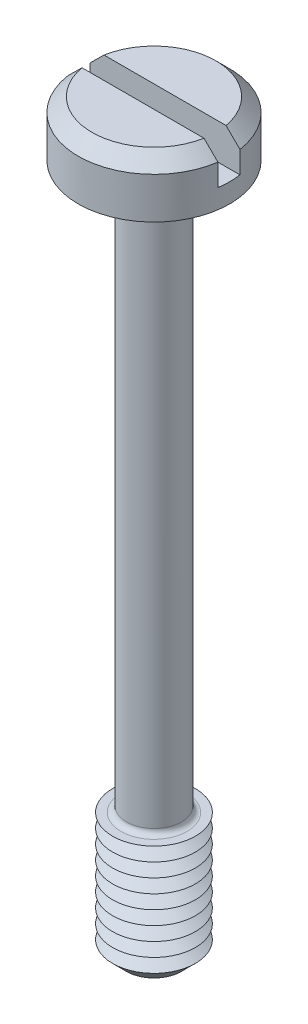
ISO-10303-21;
HEADER;
FILE_DESCRIPTION(('STEP AP214'),'2;1');
FILE_NAME('part.step','',(''),(''),'','','');
FILE_SCHEMA(('AUTOMOTIVE_DESIGN { 1 0 10303 214 1 1 1 1 }'));
ENDSEC;
DATA;
#1=APPLICATION_CONTEXT('core data for automotive mechanical design processes');
#2=APPLICATION_PROTOCOL_DEFINITION('international standard','automotive_design',2000,#1);
#3=PRODUCT_CONTEXT('',#1,'mechanical');
#4=PRODUCT('Part','Part','',(#3));
#5=PRODUCT_RELATED_PRODUCT_CATEGORY('part','',(#4));
#6=PRODUCT_DEFINITION_FORMATION('','',#4);
#7=PRODUCT_DEFINITION_CONTEXT('part definition',#1,'design');
#8=PRODUCT_DEFINITION('design','',#6,#7);
#9=PRODUCT_DEFINITION_SHAPE('','',#8);
#10=(LENGTH_UNIT() NAMED_UNIT(*) SI_UNIT(.MILLI.,.METRE.));
#11=(NAMED_UNIT(*) PLANE_ANGLE_UNIT() SI_UNIT($,.RADIAN.));
#12=(NAMED_UNIT(*) SI_UNIT($,.STERADIAN.) SOLID_ANGLE_UNIT());
#13=UNCERTAINTY_MEASURE_WITH_UNIT(LENGTH_MEASURE(1.E-05),#10,'distance_accuracy_value','');
#14=(GEOMETRIC_REPRESENTATION_CONTEXT(3) GLOBAL_UNCERTAINTY_ASSIGNED_CONTEXT((#13)) GLOBAL_UNIT_ASSIGNED_CONTEXT((#10,
#11,#12)) REPRESENTATION_CONTEXT('',''));
#15=CARTESIAN_POINT('',(0.,0.,0.));
#16=DIRECTION('',(0.,0.,1.));
#17=DIRECTION('',(1.,0.,0.));
#18=AXIS2_PLACEMENT_3D('',#15,#16,#17);
#19=CARTESIAN_POINT('',(0.,2.,0.));
#20=DIRECTION('',(0.,1.,0.));
#21=DIRECTION('',(0.,0.,1.));
#22=AXIS2_PLACEMENT_3D('',#19,#20,#21);
#23=PLANE('',#22);
#24=DIRECTION('',(-1.,0.,0.));
#25=VECTOR('',#24,1.);
#26=CARTESIAN_POINT('',(2.75,2.,-0.4));
#27=LINE('',#26,#25);
#28=CARTESIAN_POINT('',(2.21415898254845,2.,-0.4));
#29=VERTEX_POINT('',#28);
#30=CARTESIAN_POINT('',(-2.21415898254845,2.,-0.4));
#31=VERTEX_POINT('',#30);
#32=EDGE_CURVE('E110',#29,#31,#27,.T.);
#33=ORIENTED_EDGE('',*,*,#32,.F.);
#34=CARTESIAN_POINT('',(0.,2.,0.));
#35=DIRECTION('',(0.,1.,0.));
#36=DIRECTION('',(0.,0.,1.));
#37=AXIS2_PLACEMENT_3D('',#34,#35,#36);
#38=CIRCLE('',#37,2.25);
#39=EDGE_CURVE('E113',#29,#31,#38,.T.);
#40=ORIENTED_EDGE('',*,*,#39,.T.);
#41=EDGE_LOOP('',(#33,#40));
#42=FACE_BOUND('',#41,.T.);
#43=ADVANCED_FACE('F39',(#42),#23,.T.);
#44=CARTESIAN_POINT('',(0.,2.,0.));
#45=DIRECTION('',(0.,-1.,0.));
#46=DIRECTION('',(0.,0.,-1.));
#47=AXIS2_PLACEMENT_3D('',#44,#45,#46);
#48=CONICAL_SURFACE('',#47,2.25,0.785398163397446);
#49=CARTESIAN_POINT('',(6.05060089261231,-1.81380830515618,-0.4));
#50=CARTESIAN_POINT('',(5.84217393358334,-1.60583904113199,-0.4));
#51=CARTESIAN_POINT('',(5.63372707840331,-1.3978896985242,-0.4));
#52=CARTESIAN_POINT('',(5.21676338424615,-0.982052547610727,-0.4));
#53=CARTESIAN_POINT('',(5.00824654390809,-0.774164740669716,-0.4));
#54=CARTESIAN_POINT('',(4.59102343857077,-0.358383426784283,-0.4));
#55=CARTESIAN_POINT('',(4.38231713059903,-0.150489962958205,-0.4));
#56=CARTESIAN_POINT('',(3.96477014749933,0.265153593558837,-0.4));
#57=CARTESIAN_POINT('',(3.75592947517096,0.472903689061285,-0.4));
#58=CARTESIAN_POINT('',(3.33589913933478,0.89028798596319,-0.4));
#59=CARTESIAN_POINT('',(3.12470717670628,1.09991987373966,-0.4));
#60=CARTESIAN_POINT('',(2.7019134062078,1.51879562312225,-0.4));
#61=CARTESIAN_POINT('',(2.49031157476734,1.72803946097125,-0.4));
#62=CARTESIAN_POINT('',(2.17231429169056,2.04123939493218,-0.4));
#63=CARTESIAN_POINT('',(2.06623184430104,2.14551302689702,-0.4));
#64=CARTESIAN_POINT('',(1.85373145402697,2.35372301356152,-0.4));
#65=CARTESIAN_POINT('',(1.74731350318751,2.45765936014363,-0.4));
#66=CARTESIAN_POINT('',(1.53394692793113,2.6649644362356,-0.4));
#67=CARTESIAN_POINT('',(1.42699836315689,2.76833322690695,-0.4));
#68=CARTESIAN_POINT('',(1.26580938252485,2.92258234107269,-0.4));
#69=CARTESIAN_POINT('',(1.21195308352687,2.97386371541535,-0.4));
#70=CARTESIAN_POINT('',(1.10386632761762,3.07603025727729,-0.4));
#71=CARTESIAN_POINT('',(1.0496358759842,3.126915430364,-0.4));
#72=CARTESIAN_POINT('',(0.965529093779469,3.20495157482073,-0.4));
#73=CARTESIAN_POINT('',(0.935852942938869,3.23231811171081,-0.4));
#74=CARTESIAN_POINT('',(0.876282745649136,3.28681446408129,-0.4));
#75=CARTESIAN_POINT('',(0.846388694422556,3.31394427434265,-0.4));
#76=CARTESIAN_POINT('',(0.786319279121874,3.36788760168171,-0.4));
#77=CARTESIAN_POINT('',(0.756143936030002,3.39470114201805,-0.4));
#78=CARTESIAN_POINT('',(0.695411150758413,3.44788757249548,-0.4));
#79=CARTESIAN_POINT('',(0.664853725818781,3.4742604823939,-0.4));
#80=CARTESIAN_POINT('',(0.587773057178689,3.53947080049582,-0.4));
#81=CARTESIAN_POINT('',(0.540923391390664,3.57793090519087,-0.4));
#82=CARTESIAN_POINT('',(0.469108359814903,3.63368803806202,-0.4));
#83=CARTESIAN_POINT('',(0.444902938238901,3.65195872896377,-0.4));
#84=CARTESIAN_POINT('',(0.395796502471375,3.68753467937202,-0.4));
#85=CARTESIAN_POINT('',(0.370895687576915,3.70484021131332,-0.4));
#86=CARTESIAN_POINT('',(0.315135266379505,3.74129905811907,-0.4));
#87=CARTESIAN_POINT('',(0.284069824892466,3.76014262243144,-0.4));
#88=CARTESIAN_POINT('',(0.220007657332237,3.79429188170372,-0.4));
#89=CARTESIAN_POINT('',(0.187014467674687,3.80960381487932,-0.4));
#90=CARTESIAN_POINT('',(0.129469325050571,3.83013103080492,-0.4));
#91=CARTESIAN_POINT('',(0.105533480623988,3.83700748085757,-0.4));
#92=CARTESIAN_POINT('',(0.0568861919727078,3.84667143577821,-0.4));
#93=CARTESIAN_POINT('',(0.0321777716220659,3.84947323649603,-0.4));
#94=CARTESIAN_POINT('',(-0.017455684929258,3.85039131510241,-0.4));
#95=CARTESIAN_POINT('',(-0.0423811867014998,3.84848412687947,-0.4));
#96=CARTESIAN_POINT('',(-0.0915464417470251,3.8403829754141,-0.4));
#97=CARTESIAN_POINT('',(-0.115784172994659,3.83417751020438,-0.4));
#98=CARTESIAN_POINT('',(-0.16401593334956,3.81830420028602,-0.4));
#99=CARTESIAN_POINT('',(-0.18796977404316,3.80851974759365,-0.4));
#100=CARTESIAN_POINT('',(-0.234812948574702,3.78663483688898,-0.4));
#101=CARTESIAN_POINT('',(-0.257700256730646,3.77453017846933,-0.4));
#102=CARTESIAN_POINT('',(-0.302761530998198,3.74868049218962,-0.4));
#103=CARTESIAN_POINT('',(-0.324928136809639,3.73492286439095,-0.4));
#104=CARTESIAN_POINT('',(-0.368536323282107,3.70635481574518,-0.4));
#105=CARTESIAN_POINT('',(-0.389978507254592,3.69154530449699,-0.4));
#106=CARTESIAN_POINT('',(-0.457169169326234,3.64340388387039,-0.4));
#107=CARTESIAN_POINT('',(-0.501937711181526,3.60871473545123,-0.4));
#108=CARTESIAN_POINT('',(-0.590074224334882,3.53759028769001,-0.4));
#109=CARTESIAN_POINT('',(-0.633441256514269,3.50115385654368,-0.4));
#110=CARTESIAN_POINT('',(-0.719371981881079,3.42718980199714,-0.4));
#111=CARTESIAN_POINT('',(-0.761934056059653,3.3896603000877,-0.4));
#112=CARTESIAN_POINT('',(-0.846465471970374,3.31396862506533,-0.4));
#113=CARTESIAN_POINT('',(-0.888434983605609,3.27580664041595,-0.4));
#114=CARTESIAN_POINT('',(-1.01351008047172,3.16091722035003,-0.4));
#115=CARTESIAN_POINT('',(-1.09603733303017,3.0835613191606,-0.4));
#116=CARTESIAN_POINT('',(-1.26020205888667,2.92809304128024,-0.4));
#117=CARTESIAN_POINT('',(-1.3418403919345,2.84998156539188,-0.4));
#118=CARTESIAN_POINT('',(-1.50425180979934,2.69362860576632,-0.4));
#119=CARTESIAN_POINT('',(-1.58502715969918,2.61538947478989,-0.4));
#120=CARTESIAN_POINT('',(-1.74627332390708,2.45859784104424,-0.4));
#121=CARTESIAN_POINT('',(-1.82674413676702,2.38004533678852,-0.4));
#122=CARTESIAN_POINT('',(-2.06785619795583,2.14407469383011,-0.4));
#123=CARTESIAN_POINT('',(-2.22819388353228,1.98634651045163,-0.4));
#124=CARTESIAN_POINT('',(-2.54852691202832,1.67040441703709,-0.4));
#125=CARTESIAN_POINT('',(-2.70852207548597,1.51219032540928,-0.4));
#126=CARTESIAN_POINT('',(-3.02826273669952,1.19551306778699,-0.4));
#127=CARTESIAN_POINT('',(-3.18800823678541,1.03704990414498,-0.4));
#128=CARTESIAN_POINT('',(-3.6669908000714,0.561455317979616,-0.4));
#129=CARTESIAN_POINT('',(-3.98599924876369,0.244093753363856,-0.4));
#130=CARTESIAN_POINT('',(-4.6236988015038,-0.390879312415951,-0.4));
#131=CARTESIAN_POINT('',(-4.94238993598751,-0.708490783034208,-0.4));
#132=CARTESIAN_POINT('',(-5.39262624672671,-1.15743192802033,-0.4));
#133=CARTESIAN_POINT('',(-5.52423897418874,-1.28869385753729,-0.4));
#134=CARTESIAN_POINT('',(-5.78743776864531,-1.5512369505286,-0.4));
#135=CARTESIAN_POINT('',(-5.91902383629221,-1.68251811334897,-0.4));
#136=CARTESIAN_POINT('',(-6.05060089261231,-1.81380830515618,-0.4));
#137=B_SPLINE_CURVE_WITH_KNOTS('',3,(#49,#50,#51,#52,#53,#54,#55,#56,#57,#58,#59,#60,#61,#62,
#63,#64,#65,#66,#67,#68,#69,#70,#71,#72,#73,#74,#75,#76,#77,#78,#79,#80,#81,#82,#83,#84,#85,#86,
#87,#88,#89,#90,#91,#92,#93,#94,#95,#96,#97,#98,#99,#100,#101,#102,#103,#104,#105,#106,#107,
#108,#109,#110,#111,#112,#113,#114,#115,#116,#117,#118,#119,#120,#121,#122,#123,#124,#125,#126,
#127,#128,#129,#130,#131,#132,#133,#134,#135,#136),.UNSPECIFIED.,.F.,.F.,(4,2,2,2,2,2,2,2,2,2,2,
2,2,2,2,2,2,2,2,2,2,2,2,2,2,2,2,2,2,2,2,2,2,2,2,2,2,2,2,2,2,2,2,4),(0.,0.883310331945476,
1.76663897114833,2.6503821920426,3.53410755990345,4.42681573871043,5.31957687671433,
5.76582544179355,6.21208466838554,6.65829482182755,6.88139126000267,7.10448455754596,
7.22558850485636,7.34669511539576,7.46779276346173,7.58888496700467,7.77066509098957,
7.86163037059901,7.95256984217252,8.06146372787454,8.17016376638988,8.24461141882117,
8.31879723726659,8.39335348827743,8.46811002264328,8.54555790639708,8.62314734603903,
8.70137101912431,8.77952785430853,8.94932745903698,9.11923857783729,9.28946128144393,
9.45963414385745,9.79895964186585,10.1379210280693,10.475282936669,10.8126464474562,
11.4873867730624,12.1624208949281,12.8374486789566,14.1873973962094,15.5372009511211,
16.0948428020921,16.6524687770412),.UNSPECIFIED.);
#138=CARTESIAN_POINT('',(2.72075357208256,1.5,-0.4));
#139=VERTEX_POINT('',#138);
#140=EDGE_CURVE('E260',#139,#29,#137,.T.);
#141=ORIENTED_EDGE('',*,*,#140,.F.);
#142=CARTESIAN_POINT('',(0.,1.5,0.));
#143=DIRECTION('',(0.,1.,0.));
#144=DIRECTION('',(0.,0.,1.));
#145=AXIS2_PLACEMENT_3D('',#142,#143,#144);
#146=CIRCLE('',#145,2.75);
#147=CARTESIAN_POINT('',(-2.72075357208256,1.5,-0.4));
#148=VERTEX_POINT('',#147);
#149=EDGE_CURVE('E128',#148,#139,#146,.F.);
#150=ORIENTED_EDGE('',*,*,#149,.F.);
#151=EDGE_CURVE('E102',#31,#148,#137,.T.);
#152=ORIENTED_EDGE('',*,*,#151,.F.);
#153=ORIENTED_EDGE('',*,*,#39,.F.);
#154=EDGE_LOOP('',(#141,#150,#152,#153));
#155=FACE_BOUND('',#154,.T.);
#156=ADVANCED_FACE('F222',(#155),#48,.T.);
#157=CARTESIAN_POINT('',(0.,-25.,0.));
#158=DIRECTION('',(0.,1.,0.));
#159=DIRECTION('',(0.,0.,1.));
#160=AXIS2_PLACEMENT_3D('',#157,#158,#159);
#161=CYLINDRICAL_SURFACE('',#160,1.);
#162=CARTESIAN_POINT('',(0.,-20.3,0.));
#163=DIRECTION('',(0.,-1.,0.));
#164=DIRECTION('',(0.,0.,-1.));
#165=AXIS2_PLACEMENT_3D('',#162,#163,#164);
#166=CIRCLE('',#165,1.);
#167=CARTESIAN_POINT('',(0.,-20.3,-1.));
#168=VERTEX_POINT('',#167);
#169=EDGE_CURVE('E123',#168,#168,#166,.F.);
#170=ORIENTED_EDGE('',*,*,#169,.T.);
#171=EDGE_LOOP('',(#170));
#172=FACE_BOUND('',#171,.T.);
#173=CARTESIAN_POINT('',(0.,-0.199999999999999,0.));
#174=DIRECTION('',(0.,1.,0.));
#175=DIRECTION('',(0.,0.,1.));
#176=AXIS2_PLACEMENT_3D('',#173,#174,#175);
#177=CIRCLE('',#176,1.);
#178=CARTESIAN_POINT('',(0.,-0.199999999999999,1.));
#179=VERTEX_POINT('',#178);
#180=EDGE_CURVE('E365',#179,#179,#177,.F.);
#181=ORIENTED_EDGE('',*,*,#180,.T.);
#182=EDGE_LOOP('',(#181));
#183=FACE_BOUND('',#182,.T.);
#184=ADVANCED_FACE('F218',(#172,#183),#161,.T.);
#185=CARTESIAN_POINT('',(0.,2.,0.));
#186=DIRECTION('',(0.,-1.,0.));
#187=DIRECTION('',(0.,0.,-1.));
#188=AXIS2_PLACEMENT_3D('',#185,#186,#187);
#189=CYLINDRICAL_SURFACE('',#188,2.75);
#190=ORIENTED_EDGE('',*,*,#149,.T.);
#191=DIRECTION('',(0.,-1.,0.));
#192=VECTOR('',#191,1.);
#193=CARTESIAN_POINT('',(2.72075357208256,2.,-0.4));
#194=LINE('',#193,#192);
#195=CARTESIAN_POINT('',(2.72075357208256,0.7,-0.4));
#196=VERTEX_POINT('',#195);
#197=EDGE_CURVE('E64',#139,#196,#194,.T.);
#198=ORIENTED_EDGE('',*,*,#197,.T.);
#199=CARTESIAN_POINT('',(0.,0.7,0.));
#200=DIRECTION('',(0.,1.,0.));
#201=DIRECTION('',(0.,0.,1.));
#202=AXIS2_PLACEMENT_3D('',#199,#200,#201);
#203=CIRCLE('',#202,2.75);
#204=CARTESIAN_POINT('',(2.72075357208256,0.7,0.4));
#205=VERTEX_POINT('',#204);
#206=EDGE_CURVE('E11',#205,#196,#203,.T.);
#207=ORIENTED_EDGE('',*,*,#206,.F.);
#208=DIRECTION('',(0.,-1.,0.));
#209=VECTOR('',#208,1.);
#210=CARTESIAN_POINT('',(2.72075357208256,2.,0.4));
#211=LINE('',#210,#209);
#212=CARTESIAN_POINT('',(2.72075357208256,1.5,0.4));
#213=VERTEX_POINT('',#212);
#214=EDGE_CURVE('E277',#205,#213,#211,.F.);
#215=ORIENTED_EDGE('',*,*,#214,.T.);
#216=CARTESIAN_POINT('',(-2.72075357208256,1.5,0.4));
#217=VERTEX_POINT('',#216);
#218=EDGE_CURVE('E120',#213,#217,#146,.F.);
#219=ORIENTED_EDGE('',*,*,#218,.T.);
#220=DIRECTION('',(0.,-1.,0.));
#221=VECTOR('',#220,1.);
#222=CARTESIAN_POINT('',(-2.72075357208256,2.,0.4));
#223=LINE('',#222,#221);
#224=CARTESIAN_POINT('',(-2.72075357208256,0.7,0.4));
#225=VERTEX_POINT('',#224);
#226=EDGE_CURVE('E96',#217,#225,#223,.T.);
#227=ORIENTED_EDGE('',*,*,#226,.T.);
#228=CARTESIAN_POINT('',(-2.72075357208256,0.7,-0.4));
#229=VERTEX_POINT('',#228);
#230=EDGE_CURVE('E44',#229,#225,#203,.T.);
#231=ORIENTED_EDGE('',*,*,#230,.F.);
#232=DIRECTION('',(0.,-1.,0.));
#233=VECTOR('',#232,1.);
#234=CARTESIAN_POINT('',(-2.72075357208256,2.,-0.4));
#235=LINE('',#234,#233);
#236=EDGE_CURVE('E282',#229,#148,#235,.F.);
#237=ORIENTED_EDGE('',*,*,#236,.T.);
#238=EDGE_LOOP('',(#190,#198,#207,#215,#219,#227,#231,#237));
#239=FACE_BOUND('',#238,.T.);
#240=CARTESIAN_POINT('',(0.,0.,0.));
#241=DIRECTION('',(0.,1.,0.));
#242=DIRECTION('',(0.,0.,1.));
#243=AXIS2_PLACEMENT_3D('',#240,#241,#242);
#244=CIRCLE('',#243,2.75);
#245=CARTESIAN_POINT('',(0.,0.,2.75));
#246=VERTEX_POINT('',#245);
#247=EDGE_CURVE('E353',#246,#246,#244,.T.);
#248=ORIENTED_EDGE('',*,*,#247,.T.);
#249=EDGE_LOOP('',(#248));
#250=FACE_BOUND('',#249,.T.);
#251=ADVANCED_FACE('F221',(#239,#250),#189,.T.);
#252=DIRECTION('',(1.,0.,0.));
#253=VECTOR('',#252,1.);
#254=CARTESIAN_POINT('',(2.75,2.,0.4));
#255=LINE('',#254,#253);
#256=CARTESIAN_POINT('',(-2.21415898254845,2.,0.4));
#257=VERTEX_POINT('',#256);
#258=CARTESIAN_POINT('',(2.21415898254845,2.,0.4));
#259=VERTEX_POINT('',#258);
#260=EDGE_CURVE('E56',#257,#259,#255,.T.);
#261=ORIENTED_EDGE('',*,*,#260,.F.);
#262=EDGE_CURVE('E108',#257,#259,#38,.T.);
#263=ORIENTED_EDGE('',*,*,#262,.T.);
#264=EDGE_LOOP('',(#261,#263));
#265=FACE_BOUND('',#264,.T.);
#266=ADVANCED_FACE('F107',(#265),#23,.T.);
#267=CARTESIAN_POINT('',(0.,0.,0.));
#268=DIRECTION('',(0.,1.,0.));
#269=DIRECTION('',(0.,0.,1.));
#270=AXIS2_PLACEMENT_3D('',#267,#268,#269);
#271=PLANE('',#270);
#272=CARTESIAN_POINT('',(0.,0.,0.));
#273=DIRECTION('',(0.,1.,0.));
#274=DIRECTION('',(0.,0.,1.));
#275=AXIS2_PLACEMENT_3D('',#272,#273,#274);
#276=CIRCLE('',#275,1.2);
#277=CARTESIAN_POINT('',(0.,0.,1.2));
#278=VERTEX_POINT('',#277);
#279=EDGE_CURVE('E114',#278,#278,#276,.T.);
#280=ORIENTED_EDGE('',*,*,#279,.T.);
#281=EDGE_LOOP('',(#280));
#282=FACE_BOUND('',#281,.T.);
#283=ORIENTED_EDGE('',*,*,#247,.F.);
#284=EDGE_LOOP('',(#283));
#285=FACE_BOUND('',#284,.T.);
#286=ADVANCED_FACE('F212',(#282,#285),#271,.F.);
#287=CARTESIAN_POINT('',(0.,-20.5,0.));
#288=DIRECTION('',(0.,-1.,0.));
#289=DIRECTION('',(0.,0.,-1.));
#290=AXIS2_PLACEMENT_3D('',#287,#288,#289);
#291=PLANE('',#290);
#292=CARTESIAN_POINT('',(0.,-20.5,0.));
#293=DIRECTION('',(0.,-1.,0.));
#294=DIRECTION('',(0.,0.,-1.));
#295=AXIS2_PLACEMENT_3D('',#292,#293,#294);
#296=CIRCLE('',#295,1.2);
#297=CARTESIAN_POINT('',(0.,-20.5,-1.2));
#298=VERTEX_POINT('',#297);
#299=EDGE_CURVE('E361',#298,#298,#296,.T.);
#300=ORIENTED_EDGE('',*,*,#299,.T.);
#301=EDGE_LOOP('',(#300));
#302=FACE_BOUND('',#301,.T.);
#303=CARTESIAN_POINT('',(0.,-20.5,0.));
#304=DIRECTION('',(0.,1.,0.));
#305=DIRECTION('',(0.,0.,1.));
#306=AXIS2_PLACEMENT_3D('',#303,#304,#305);
#307=CIRCLE('',#306,1.5);
#308=CARTESIAN_POINT('',(0.,-20.5,1.5));
#309=VERTEX_POINT('',#308);
#310=EDGE_CURVE('E349',#309,#309,#307,.T.);
#311=ORIENTED_EDGE('',*,*,#310,.T.);
#312=EDGE_LOOP('',(#311));
#313=FACE_BOUND('',#312,.T.);
#314=ADVANCED_FACE('F208',(#302,#313),#291,.F.);
#315=CARTESIAN_POINT('',(0.,-20.75,0.));
#316=DIRECTION('',(0.,1.,0.));
#317=DIRECTION('',(0.,0.,1.));
#318=AXIS2_PLACEMENT_3D('',#315,#316,#317);
#319=CONICAL_SURFACE('',#318,1.06698729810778,1.0471975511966);
#320=ORIENTED_EDGE('',*,*,#310,.F.);
#321=EDGE_LOOP('',(#320));
#322=FACE_BOUND('',#321,.T.);
#323=CARTESIAN_POINT('',(0.,-20.75,0.));
#324=DIRECTION('',(0.,1.,0.));
#325=DIRECTION('',(0.,0.,1.));
#326=AXIS2_PLACEMENT_3D('',#323,#324,#325);
#327=CIRCLE('',#326,1.06698729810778);
#328=CARTESIAN_POINT('',(0.,-20.75,1.06698729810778));
#329=VERTEX_POINT('',#328);
#330=EDGE_CURVE('E345',#329,#329,#327,.T.);
#331=ORIENTED_EDGE('',*,*,#330,.T.);
#332=EDGE_LOOP('',(#331));
#333=FACE_BOUND('',#332,.T.);
#334=ADVANCED_FACE('F204',(#322,#333),#319,.T.);
#335=CARTESIAN_POINT('',(0.,-21.,0.));
#336=DIRECTION('',(0.,-1.,0.));
#337=DIRECTION('',(0.,0.,-1.));
#338=AXIS2_PLACEMENT_3D('',#335,#336,#337);
#339=CONICAL_SURFACE('',#338,1.5,1.0471975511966);
#340=ORIENTED_EDGE('',*,*,#330,.F.);
#341=EDGE_LOOP('',(#340));
#342=FACE_BOUND('',#341,.T.);
#343=CARTESIAN_POINT('',(0.,-21.,0.));
#344=DIRECTION('',(0.,1.,0.));
#345=DIRECTION('',(0.,0.,1.));
#346=AXIS2_PLACEMENT_3D('',#343,#344,#345);
#347=CIRCLE('',#346,1.5);
#348=CARTESIAN_POINT('',(0.,-21.,1.5));
#349=VERTEX_POINT('',#348);
#350=EDGE_CURVE('E342',#349,#349,#347,.T.);
#351=ORIENTED_EDGE('',*,*,#350,.T.);
#352=EDGE_LOOP('',(#351));
#353=FACE_BOUND('',#352,.T.);
#354=ADVANCED_FACE('F200',(#342,#353),#339,.T.);
#355=CARTESIAN_POINT('',(0.,-21.25,0.));
#356=DIRECTION('',(0.,1.,0.));
#357=DIRECTION('',(0.,0.,1.));
#358=AXIS2_PLACEMENT_3D('',#355,#356,#357);
#359=CONICAL_SURFACE('',#358,1.06698729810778,1.0471975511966);
#360=ORIENTED_EDGE('',*,*,#350,.F.);
#361=EDGE_LOOP('',(#360));
#362=FACE_BOUND('',#361,.T.);
#363=CARTESIAN_POINT('',(0.,-21.25,0.));
#364=DIRECTION('',(0.,1.,0.));
#365=DIRECTION('',(0.,0.,1.));
#366=AXIS2_PLACEMENT_3D('',#363,#364,#365);
#367=CIRCLE('',#366,1.06698729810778);
#368=CARTESIAN_POINT('',(0.,-21.25,1.06698729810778));
#369=VERTEX_POINT('',#368);
#370=EDGE_CURVE('E338',#369,#369,#367,.T.);
#371=ORIENTED_EDGE('',*,*,#370,.T.);
#372=EDGE_LOOP('',(#371));
#373=FACE_BOUND('',#372,.T.);
#374=ADVANCED_FACE('F196',(#362,#373),#359,.T.);
#375=CARTESIAN_POINT('',(0.,-21.5,0.));
#376=DIRECTION('',(0.,-1.,0.));
#377=DIRECTION('',(0.,0.,-1.));
#378=AXIS2_PLACEMENT_3D('',#375,#376,#377);
#379=CONICAL_SURFACE('',#378,1.5,1.0471975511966);
#380=ORIENTED_EDGE('',*,*,#370,.F.);
#381=EDGE_LOOP('',(#380));
#382=FACE_BOUND('',#381,.T.);
#383=CARTESIAN_POINT('',(0.,-21.5,0.));
#384=DIRECTION('',(0.,1.,0.));
#385=DIRECTION('',(0.,0.,1.));
#386=AXIS2_PLACEMENT_3D('',#383,#384,#385);
#387=CIRCLE('',#386,1.5);
#388=CARTESIAN_POINT('',(0.,-21.5,1.5));
#389=VERTEX_POINT('',#388);
#390=EDGE_CURVE('E334',#389,#389,#387,.T.);
#391=ORIENTED_EDGE('',*,*,#390,.T.);
#392=EDGE_LOOP('',(#391));
#393=FACE_BOUND('',#392,.T.);
#394=ADVANCED_FACE('F192',(#382,#393),#379,.T.);
#395=CARTESIAN_POINT('',(0.,-21.75,0.));
#396=DIRECTION('',(0.,1.,0.));
#397=DIRECTION('',(0.,0.,1.));
#398=AXIS2_PLACEMENT_3D('',#395,#396,#397);
#399=CONICAL_SURFACE('',#398,1.06698729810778,1.0471975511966);
#400=ORIENTED_EDGE('',*,*,#390,.F.);
#401=EDGE_LOOP('',(#400));
#402=FACE_BOUND('',#401,.T.);
#403=CARTESIAN_POINT('',(0.,-21.75,0.));
#404=DIRECTION('',(0.,1.,0.));
#405=DIRECTION('',(0.,0.,1.));
#406=AXIS2_PLACEMENT_3D('',#403,#404,#405);
#407=CIRCLE('',#406,1.06698729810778);
#408=CARTESIAN_POINT('',(0.,-21.75,1.06698729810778));
#409=VERTEX_POINT('',#408);
#410=EDGE_CURVE('E330',#409,#409,#407,.T.);
#411=ORIENTED_EDGE('',*,*,#410,.T.);
#412=EDGE_LOOP('',(#411));
#413=FACE_BOUND('',#412,.T.);
#414=ADVANCED_FACE('F188',(#402,#413),#399,.T.);
#415=CARTESIAN_POINT('',(0.,-22.,0.));
#416=DIRECTION('',(0.,-1.,0.));
#417=DIRECTION('',(0.,0.,-1.));
#418=AXIS2_PLACEMENT_3D('',#415,#416,#417);
#419=CONICAL_SURFACE('',#418,1.5,1.0471975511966);
#420=ORIENTED_EDGE('',*,*,#410,.F.);
#421=EDGE_LOOP('',(#420));
#422=FACE_BOUND('',#421,.T.);
#423=CARTESIAN_POINT('',(0.,-22.,0.));
#424=DIRECTION('',(0.,1.,0.));
#425=DIRECTION('',(0.,0.,1.));
#426=AXIS2_PLACEMENT_3D('',#423,#424,#425);
#427=CIRCLE('',#426,1.5);
#428=CARTESIAN_POINT('',(0.,-22.,1.5));
#429=VERTEX_POINT('',#428);
#430=EDGE_CURVE('E327',#429,#429,#427,.T.);
#431=ORIENTED_EDGE('',*,*,#430,.T.);
#432=EDGE_LOOP('',(#431));
#433=FACE_BOUND('',#432,.T.);
#434=ADVANCED_FACE('F184',(#422,#433),#419,.T.);
#435=CARTESIAN_POINT('',(0.,-22.25,0.));
#436=DIRECTION('',(0.,1.,0.));
#437=DIRECTION('',(0.,0.,1.));
#438=AXIS2_PLACEMENT_3D('',#435,#436,#437);
#439=CONICAL_SURFACE('',#438,1.06698729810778,1.0471975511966);
#440=ORIENTED_EDGE('',*,*,#430,.F.);
#441=EDGE_LOOP('',(#440));
#442=FACE_BOUND('',#441,.T.);
#443=CARTESIAN_POINT('',(0.,-22.25,0.));
#444=DIRECTION('',(0.,1.,0.));
#445=DIRECTION('',(0.,0.,1.));
#446=AXIS2_PLACEMENT_3D('',#443,#444,#445);
#447=CIRCLE('',#446,1.06698729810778);
#448=CARTESIAN_POINT('',(0.,-22.25,1.06698729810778));
#449=VERTEX_POINT('',#448);
#450=EDGE_CURVE('E323',#449,#449,#447,.T.);
#451=ORIENTED_EDGE('',*,*,#450,.T.);
#452=EDGE_LOOP('',(#451));
#453=FACE_BOUND('',#452,.T.);
#454=ADVANCED_FACE('F180',(#442,#453),#439,.T.);
#455=CARTESIAN_POINT('',(0.,-22.5,0.));
#456=DIRECTION('',(0.,-1.,0.));
#457=DIRECTION('',(0.,0.,-1.));
#458=AXIS2_PLACEMENT_3D('',#455,#456,#457);
#459=CONICAL_SURFACE('',#458,1.5,1.0471975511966);
#460=ORIENTED_EDGE('',*,*,#450,.F.);
#461=EDGE_LOOP('',(#460));
#462=FACE_BOUND('',#461,.T.);
#463=CARTESIAN_POINT('',(0.,-22.5,0.));
#464=DIRECTION('',(0.,1.,0.));
#465=DIRECTION('',(0.,0.,1.));
#466=AXIS2_PLACEMENT_3D('',#463,#464,#465);
#467=CIRCLE('',#466,1.5);
#468=CARTESIAN_POINT('',(0.,-22.5,1.5));
#469=VERTEX_POINT('',#468);
#470=EDGE_CURVE('E320',#469,#469,#467,.T.);
#471=ORIENTED_EDGE('',*,*,#470,.T.);
#472=EDGE_LOOP('',(#471));
#473=FACE_BOUND('',#472,.T.);
#474=ADVANCED_FACE('F176',(#462,#473),#459,.T.);
#475=CARTESIAN_POINT('',(0.,-22.75,0.));
#476=DIRECTION('',(0.,1.,0.));
#477=DIRECTION('',(0.,0.,1.));
#478=AXIS2_PLACEMENT_3D('',#475,#476,#477);
#479=CONICAL_SURFACE('',#478,1.06698729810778,1.0471975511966);
#480=ORIENTED_EDGE('',*,*,#470,.F.);
#481=EDGE_LOOP('',(#480));
#482=FACE_BOUND('',#481,.T.);
#483=CARTESIAN_POINT('',(0.,-22.75,0.));
#484=DIRECTION('',(0.,1.,0.));
#485=DIRECTION('',(0.,0.,1.));
#486=AXIS2_PLACEMENT_3D('',#483,#484,#485);
#487=CIRCLE('',#486,1.06698729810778);
#488=CARTESIAN_POINT('',(0.,-22.75,1.06698729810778));
#489=VERTEX_POINT('',#488);
#490=EDGE_CURVE('E317',#489,#489,#487,.T.);
#491=ORIENTED_EDGE('',*,*,#490,.T.);
#492=EDGE_LOOP('',(#491));
#493=FACE_BOUND('',#492,.T.);
#494=ADVANCED_FACE('F172',(#482,#493),#479,.T.);
#495=CARTESIAN_POINT('',(0.,-23.,0.));
#496=DIRECTION('',(0.,-1.,0.));
#497=DIRECTION('',(0.,0.,-1.));
#498=AXIS2_PLACEMENT_3D('',#495,#496,#497);
#499=CONICAL_SURFACE('',#498,1.5,1.0471975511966);
#500=ORIENTED_EDGE('',*,*,#490,.F.);
#501=EDGE_LOOP('',(#500));
#502=FACE_BOUND('',#501,.T.);
#503=CARTESIAN_POINT('',(0.,-23.,0.));
#504=DIRECTION('',(0.,1.,0.));
#505=DIRECTION('',(0.,0.,1.));
#506=AXIS2_PLACEMENT_3D('',#503,#504,#505);
#507=CIRCLE('',#506,1.5);
#508=CARTESIAN_POINT('',(0.,-23.,1.5));
#509=VERTEX_POINT('',#508);
#510=EDGE_CURVE('E314',#509,#509,#507,.T.);
#511=ORIENTED_EDGE('',*,*,#510,.T.);
#512=EDGE_LOOP('',(#511));
#513=FACE_BOUND('',#512,.T.);
#514=ADVANCED_FACE('F168',(#502,#513),#499,.T.);
#515=CARTESIAN_POINT('',(0.,-23.25,0.));
#516=DIRECTION('',(0.,1.,0.));
#517=DIRECTION('',(0.,0.,1.));
#518=AXIS2_PLACEMENT_3D('',#515,#516,#517);
#519=CONICAL_SURFACE('',#518,1.06698729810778,1.0471975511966);
#520=ORIENTED_EDGE('',*,*,#510,.F.);
#521=EDGE_LOOP('',(#520));
#522=FACE_BOUND('',#521,.T.);
#523=CARTESIAN_POINT('',(0.,-23.25,0.));
#524=DIRECTION('',(0.,1.,0.));
#525=DIRECTION('',(0.,0.,1.));
#526=AXIS2_PLACEMENT_3D('',#523,#524,#525);
#527=CIRCLE('',#526,1.06698729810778);
#528=CARTESIAN_POINT('',(0.,-23.25,1.06698729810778));
#529=VERTEX_POINT('',#528);
#530=EDGE_CURVE('E311',#529,#529,#527,.T.);
#531=ORIENTED_EDGE('',*,*,#530,.T.);
#532=EDGE_LOOP('',(#531));
#533=FACE_BOUND('',#532,.T.);
#534=ADVANCED_FACE('F164',(#522,#533),#519,.T.);
#535=CARTESIAN_POINT('',(0.,-23.5,0.));
#536=DIRECTION('',(0.,-1.,0.));
#537=DIRECTION('',(0.,0.,-1.));
#538=AXIS2_PLACEMENT_3D('',#535,#536,#537);
#539=CONICAL_SURFACE('',#538,1.5,1.0471975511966);
#540=ORIENTED_EDGE('',*,*,#530,.F.);
#541=EDGE_LOOP('',(#540));
#542=FACE_BOUND('',#541,.T.);
#543=CARTESIAN_POINT('',(0.,-23.5,0.));
#544=DIRECTION('',(0.,1.,0.));
#545=DIRECTION('',(0.,0.,1.));
#546=AXIS2_PLACEMENT_3D('',#543,#544,#545);
#547=CIRCLE('',#546,1.5);
#548=CARTESIAN_POINT('',(0.,-23.5,1.5));
#549=VERTEX_POINT('',#548);
#550=EDGE_CURVE('E307',#549,#549,#547,.T.);
#551=ORIENTED_EDGE('',*,*,#550,.T.);
#552=EDGE_LOOP('',(#551));
#553=FACE_BOUND('',#552,.T.);
#554=ADVANCED_FACE('F160',(#542,#553),#539,.T.);
#555=CARTESIAN_POINT('',(0.,-23.75,0.));
#556=DIRECTION('',(0.,1.,0.));
#557=DIRECTION('',(0.,0.,1.));
#558=AXIS2_PLACEMENT_3D('',#555,#556,#557);
#559=CONICAL_SURFACE('',#558,1.06698729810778,1.0471975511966);
#560=ORIENTED_EDGE('',*,*,#550,.F.);
#561=EDGE_LOOP('',(#560));
#562=FACE_BOUND('',#561,.T.);
#563=CARTESIAN_POINT('',(0.,-23.75,0.));
#564=DIRECTION('',(0.,1.,0.));
#565=DIRECTION('',(0.,0.,1.));
#566=AXIS2_PLACEMENT_3D('',#563,#564,#565);
#567=CIRCLE('',#566,1.06698729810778);
#568=CARTESIAN_POINT('',(0.,-23.75,1.06698729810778));
#569=VERTEX_POINT('',#568);
#570=EDGE_CURVE('E303',#569,#569,#567,.T.);
#571=ORIENTED_EDGE('',*,*,#570,.T.);
#572=EDGE_LOOP('',(#571));
#573=FACE_BOUND('',#572,.T.);
#574=ADVANCED_FACE('F156',(#562,#573),#559,.T.);
#575=CARTESIAN_POINT('',(0.,-24.,0.));
#576=DIRECTION('',(0.,-1.,0.));
#577=DIRECTION('',(0.,0.,-1.));
#578=AXIS2_PLACEMENT_3D('',#575,#576,#577);
#579=CONICAL_SURFACE('',#578,1.5,1.0471975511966);
#580=ORIENTED_EDGE('',*,*,#570,.F.);
#581=EDGE_LOOP('',(#580));
#582=FACE_BOUND('',#581,.T.);
#583=CARTESIAN_POINT('',(0.,-24.,0.));
#584=DIRECTION('',(0.,1.,0.));
#585=DIRECTION('',(0.,0.,1.));
#586=AXIS2_PLACEMENT_3D('',#583,#584,#585);
#587=CIRCLE('',#586,1.5);
#588=CARTESIAN_POINT('',(0.,-24.,1.5));
#589=VERTEX_POINT('',#588);
#590=EDGE_CURVE('E299',#589,#589,#587,.T.);
#591=ORIENTED_EDGE('',*,*,#590,.T.);
#592=EDGE_LOOP('',(#591));
#593=FACE_BOUND('',#592,.T.);
#594=ADVANCED_FACE('F152',(#582,#593),#579,.T.);
#595=CARTESIAN_POINT('',(0.,-24.25,0.));
#596=DIRECTION('',(0.,1.,0.));
#597=DIRECTION('',(0.,0.,1.));
#598=AXIS2_PLACEMENT_3D('',#595,#596,#597);
#599=CONICAL_SURFACE('',#598,1.06698729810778,1.0471975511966);
#600=ORIENTED_EDGE('',*,*,#590,.F.);
#601=EDGE_LOOP('',(#600));
#602=FACE_BOUND('',#601,.T.);
#603=CARTESIAN_POINT('',(0.,-24.25,0.));
#604=DIRECTION('',(0.,1.,0.));
#605=DIRECTION('',(0.,0.,1.));
#606=AXIS2_PLACEMENT_3D('',#603,#604,#605);
#607=CIRCLE('',#606,1.06698729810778);
#608=CARTESIAN_POINT('',(0.,-24.25,1.06698729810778));
#609=VERTEX_POINT('',#608);
#610=EDGE_CURVE('E296',#609,#609,#607,.T.);
#611=ORIENTED_EDGE('',*,*,#610,.T.);
#612=EDGE_LOOP('',(#611));
#613=FACE_BOUND('',#612,.T.);
#614=ADVANCED_FACE('F148',(#602,#613),#599,.T.);
#615=CARTESIAN_POINT('',(0.,-24.5,0.));
#616=DIRECTION('',(0.,-1.,0.));
#617=DIRECTION('',(0.,0.,-1.));
#618=AXIS2_PLACEMENT_3D('',#615,#616,#617);
#619=CONICAL_SURFACE('',#618,1.5,1.0471975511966);
#620=ORIENTED_EDGE('',*,*,#610,.F.);
#621=EDGE_LOOP('',(#620));
#622=FACE_BOUND('',#621,.T.);
#623=CARTESIAN_POINT('',(0.,-24.5,0.));
#624=DIRECTION('',(0.,1.,0.));
#625=DIRECTION('',(0.,0.,1.));
#626=AXIS2_PLACEMENT_3D('',#623,#624,#625);
#627=CIRCLE('',#626,1.5);
#628=CARTESIAN_POINT('',(0.,-24.5,1.5));
#629=VERTEX_POINT('',#628);
#630=EDGE_CURVE('E292',#629,#629,#627,.T.);
#631=ORIENTED_EDGE('',*,*,#630,.T.);
#632=EDGE_LOOP('',(#631));
#633=FACE_BOUND('',#632,.T.);
#634=ADVANCED_FACE('F144',(#622,#633),#619,.T.);
#635=CARTESIAN_POINT('',(0.,-25.,0.));
#636=DIRECTION('',(0.,-1.,0.));
#637=DIRECTION('',(0.,0.,-1.));
#638=AXIS2_PLACEMENT_3D('',#635,#636,#637);
#639=PLANE('',#638);
#640=CARTESIAN_POINT('',(0.,-25.,0.));
#641=DIRECTION('',(0.,-1.,0.));
#642=DIRECTION('',(0.,0.,-1.));
#643=AXIS2_PLACEMENT_3D('',#640,#641,#642);
#644=CIRCLE('',#643,0.999999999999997);
#645=CARTESIAN_POINT('',(0.,-25.,-0.999999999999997));
#646=VERTEX_POINT('',#645);
#647=EDGE_CURVE('E357',#646,#646,#644,.T.);
#648=ORIENTED_EDGE('',*,*,#647,.T.);
#649=EDGE_LOOP('',(#648));
#650=FACE_BOUND('',#649,.T.);
#651=ADVANCED_FACE('F147',(#650),#639,.T.);
#652=CARTESIAN_POINT('',(0.,-25.,0.));
#653=DIRECTION('',(0.,1.,0.));
#654=DIRECTION('',(0.,0.,1.));
#655=AXIS2_PLACEMENT_3D('',#652,#653,#654);
#656=CONICAL_SURFACE('',#655,0.999999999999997,0.785398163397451);
#657=ORIENTED_EDGE('',*,*,#630,.F.);
#658=EDGE_LOOP('',(#657));
#659=FACE_BOUND('',#658,.T.);
#660=ORIENTED_EDGE('',*,*,#647,.F.);
#661=EDGE_LOOP('',(#660));
#662=FACE_BOUND('',#661,.T.);
#663=ADVANCED_FACE('F216',(#659,#662),#656,.T.);
#664=CARTESIAN_POINT('',(0.,-20.3,0.));
#665=DIRECTION('',(0.,-1.,0.));
#666=DIRECTION('',(0.,0.,-1.));
#667=AXIS2_PLACEMENT_3D('',#664,#665,#666);
#668=TOROIDAL_SURFACE('',#667,1.2,0.2);
#669=ORIENTED_EDGE('',*,*,#169,.F.);
#670=EDGE_LOOP('',(#669));
#671=FACE_BOUND('',#670,.T.);
#672=ORIENTED_EDGE('',*,*,#299,.F.);
#673=EDGE_LOOP('',(#672));
#674=FACE_BOUND('',#673,.T.);
#675=ADVANCED_FACE('F234',(#671,#674),#668,.F.);
#676=CARTESIAN_POINT('',(0.,-0.199999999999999,0.));
#677=DIRECTION('',(0.,1.,0.));
#678=DIRECTION('',(0.,0.,1.));
#679=AXIS2_PLACEMENT_3D('',#676,#677,#678);
#680=TOROIDAL_SURFACE('',#679,1.2,0.2);
#681=ORIENTED_EDGE('',*,*,#279,.F.);
#682=EDGE_LOOP('',(#681));
#683=FACE_BOUND('',#682,.T.);
#684=ORIENTED_EDGE('',*,*,#180,.F.);
#685=EDGE_LOOP('',(#684));
#686=FACE_BOUND('',#685,.T.);
#687=ADVANCED_FACE('F237',(#683,#686),#680,.F.);
#688=CARTESIAN_POINT('',(-6.05060089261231,-1.81380830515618,0.4));
#689=CARTESIAN_POINT('',(-5.84217393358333,-1.60583904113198,0.4));
#690=CARTESIAN_POINT('',(-5.63372707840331,-1.3978896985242,0.4));
#691=CARTESIAN_POINT('',(-5.21676338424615,-0.982052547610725,0.4));
#692=CARTESIAN_POINT('',(-5.00824654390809,-0.774164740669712,0.4));
#693=CARTESIAN_POINT('',(-4.59102343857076,-0.358383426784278,0.4));
#694=CARTESIAN_POINT('',(-4.38231713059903,-0.150489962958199,0.4));
#695=CARTESIAN_POINT('',(-3.96477014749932,0.265153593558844,0.4));
#696=CARTESIAN_POINT('',(-3.75592947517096,0.472903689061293,0.4));
#697=CARTESIAN_POINT('',(-3.33589913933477,0.890287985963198,0.4));
#698=CARTESIAN_POINT('',(-3.12470717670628,1.09991987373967,0.4));
#699=CARTESIAN_POINT('',(-2.7019134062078,1.51879562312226,0.4));
#700=CARTESIAN_POINT('',(-2.49031157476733,1.72803946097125,0.4));
#701=CARTESIAN_POINT('',(-2.17231429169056,2.04123939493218,0.4));
#702=CARTESIAN_POINT('',(-2.06623184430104,2.14551302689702,0.4));
#703=CARTESIAN_POINT('',(-1.85373145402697,2.35372301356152,0.4));
#704=CARTESIAN_POINT('',(-1.74731350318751,2.45765936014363,0.4));
#705=CARTESIAN_POINT('',(-1.53394692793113,2.6649644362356,0.4));
#706=CARTESIAN_POINT('',(-1.42699836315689,2.76833322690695,0.4));
#707=CARTESIAN_POINT('',(-1.26580938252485,2.92258234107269,0.4));
#708=CARTESIAN_POINT('',(-1.21195308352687,2.97386371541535,0.4));
#709=CARTESIAN_POINT('',(-1.10386632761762,3.07603025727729,0.4));
#710=CARTESIAN_POINT('',(-1.0496358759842,3.126915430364,0.4));
#711=CARTESIAN_POINT('',(-0.96552909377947,3.20495157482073,0.4));
#712=CARTESIAN_POINT('',(-0.935852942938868,3.23231811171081,0.4));
#713=CARTESIAN_POINT('',(-0.876282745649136,3.28681446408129,0.4));
#714=CARTESIAN_POINT('',(-0.846388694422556,3.31394427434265,0.4));
#715=CARTESIAN_POINT('',(-0.786319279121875,3.36788760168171,0.4));
#716=CARTESIAN_POINT('',(-0.756143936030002,3.39470114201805,0.4));
#717=CARTESIAN_POINT('',(-0.695411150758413,3.44788757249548,0.4));
#718=CARTESIAN_POINT('',(-0.664853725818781,3.4742604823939,0.4));
#719=CARTESIAN_POINT('',(-0.58777305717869,3.53947080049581,0.4));
#720=CARTESIAN_POINT('',(-0.540923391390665,3.57793090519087,0.4));
#721=CARTESIAN_POINT('',(-0.469108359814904,3.63368803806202,0.4));
#722=CARTESIAN_POINT('',(-0.444902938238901,3.65195872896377,0.4));
#723=CARTESIAN_POINT('',(-0.395796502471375,3.68753467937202,0.4));
#724=CARTESIAN_POINT('',(-0.370895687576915,3.70484021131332,0.4));
#725=CARTESIAN_POINT('',(-0.315135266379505,3.74129905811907,0.4));
#726=CARTESIAN_POINT('',(-0.284069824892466,3.76014262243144,0.4));
#727=CARTESIAN_POINT('',(-0.220007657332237,3.79429188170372,0.4));
#728=CARTESIAN_POINT('',(-0.187014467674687,3.80960381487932,0.4));
#729=CARTESIAN_POINT('',(-0.12946932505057,3.83013103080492,0.4));
#730=CARTESIAN_POINT('',(-0.105533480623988,3.83700748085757,0.4));
#731=CARTESIAN_POINT('',(-0.0568861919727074,3.84667143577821,0.4));
#732=CARTESIAN_POINT('',(-0.0321777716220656,3.84947323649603,0.4));
#733=CARTESIAN_POINT('',(0.0174556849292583,3.85039131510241,0.4));
#734=CARTESIAN_POINT('',(0.0423811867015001,3.84848412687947,0.4));
#735=CARTESIAN_POINT('',(0.0915464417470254,3.8403829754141,0.4));
#736=CARTESIAN_POINT('',(0.115784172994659,3.83417751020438,0.4));
#737=CARTESIAN_POINT('',(0.16401593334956,3.81830420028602,0.4));
#738=CARTESIAN_POINT('',(0.187969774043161,3.80851974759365,0.4));
#739=CARTESIAN_POINT('',(0.234812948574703,3.78663483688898,0.4));
#740=CARTESIAN_POINT('',(0.257700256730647,3.77453017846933,0.4));
#741=CARTESIAN_POINT('',(0.302761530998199,3.74868049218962,0.4));
#742=CARTESIAN_POINT('',(0.32492813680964,3.73492286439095,0.4));
#743=CARTESIAN_POINT('',(0.368536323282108,3.70635481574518,0.4));
#744=CARTESIAN_POINT('',(0.389978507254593,3.69154530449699,0.4));
#745=CARTESIAN_POINT('',(0.457169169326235,3.64340388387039,0.4));
#746=CARTESIAN_POINT('',(0.501937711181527,3.60871473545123,0.4));
#747=CARTESIAN_POINT('',(0.590074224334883,3.53759028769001,0.4));
#748=CARTESIAN_POINT('',(0.633441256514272,3.50115385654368,0.4));
#749=CARTESIAN_POINT('',(0.719371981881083,3.42718980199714,0.4));
#750=CARTESIAN_POINT('',(0.761934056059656,3.3896603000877,0.4));
#751=CARTESIAN_POINT('',(0.846465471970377,3.31396862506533,0.4));
#752=CARTESIAN_POINT('',(0.888434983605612,3.27580664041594,0.4));
#753=CARTESIAN_POINT('',(1.01351008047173,3.16091722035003,0.4));
#754=CARTESIAN_POINT('',(1.09603733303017,3.0835613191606,0.4));
#755=CARTESIAN_POINT('',(1.26020205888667,2.92809304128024,0.4));
#756=CARTESIAN_POINT('',(1.34184039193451,2.84998156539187,0.4));
#757=CARTESIAN_POINT('',(1.50425180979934,2.69362860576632,0.4));
#758=CARTESIAN_POINT('',(1.58502715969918,2.61538947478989,0.4));
#759=CARTESIAN_POINT('',(1.74627332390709,2.45859784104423,0.4));
#760=CARTESIAN_POINT('',(1.82674413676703,2.38004533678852,0.4));
#761=CARTESIAN_POINT('',(2.06785619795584,2.14407469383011,0.4));
#762=CARTESIAN_POINT('',(2.22819388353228,1.98634651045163,0.4));
#763=CARTESIAN_POINT('',(2.54852691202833,1.67040441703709,0.4));
#764=CARTESIAN_POINT('',(2.70852207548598,1.51219032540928,0.4));
#765=CARTESIAN_POINT('',(3.02826273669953,1.19551306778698,0.4));
#766=CARTESIAN_POINT('',(3.18800823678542,1.03704990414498,0.4));
#767=CARTESIAN_POINT('',(3.66699080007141,0.561455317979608,0.4));
#768=CARTESIAN_POINT('',(3.9859992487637,0.244093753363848,0.4));
#769=CARTESIAN_POINT('',(4.62369880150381,-0.39087931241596,0.4));
#770=CARTESIAN_POINT('',(4.94238993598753,-0.708490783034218,0.4));
#771=CARTESIAN_POINT('',(5.39262624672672,-1.15743192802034,0.4));
#772=CARTESIAN_POINT('',(5.52423897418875,-1.28869385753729,0.4));
#773=CARTESIAN_POINT('',(5.78743776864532,-1.5512369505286,0.4));
#774=CARTESIAN_POINT('',(5.91902383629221,-1.68251811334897,0.4));
#775=CARTESIAN_POINT('',(6.05060089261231,-1.81380830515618,0.4));
#776=B_SPLINE_CURVE_WITH_KNOTS('',3,(#688,#689,#690,#691,#692,#693,#694,#695,#696,#697,#698,
#699,#700,#701,#702,#703,#704,#705,#706,#707,#708,#709,#710,#711,#712,#713,#714,#715,#716,#717,
#718,#719,#720,#721,#722,#723,#724,#725,#726,#727,#728,#729,#730,#731,#732,#733,#734,#735,#736,
#737,#738,#739,#740,#741,#742,#743,#744,#745,#746,#747,#748,#749,#750,#751,#752,#753,#754,#755,
#756,#757,#758,#759,#760,#761,#762,#763,#764,#765,#766,#767,#768,#769,#770,#771,#772,#773,#774,
#775),.UNSPECIFIED.,.F.,.F.,(4,2,2,2,2,2,2,2,2,2,2,2,2,2,2,2,2,2,2,2,2,2,2,2,2,2,2,2,2,2,2,2,2,
2,2,2,2,2,2,2,2,2,2,4),(0.,0.883310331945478,1.76663897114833,2.65038219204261,3.53410755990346,
4.42681573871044,5.31957687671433,5.76582544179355,6.21208466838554,6.65829482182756,
6.88139126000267,7.10448455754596,7.22558850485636,7.34669511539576,7.46779276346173,
7.58888496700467,7.77066509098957,7.861630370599,7.95256984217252,8.06146372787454,
8.17016376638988,8.24461141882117,8.31879723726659,8.39335348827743,8.46811002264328,
8.54555790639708,8.62314734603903,8.70137101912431,8.77952785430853,8.94932745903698,
9.1192385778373,9.28946128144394,9.45963414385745,9.79895964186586,10.1379210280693,
10.475282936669,10.8126464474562,11.4873867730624,12.1624208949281,12.8374486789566,
14.1873973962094,15.5372009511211,16.0948428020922,16.6524687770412),.UNSPECIFIED.);
#777=EDGE_CURVE('E92',#217,#257,#776,.T.);
#778=ORIENTED_EDGE('',*,*,#777,.F.);
#779=ORIENTED_EDGE('',*,*,#218,.F.);
#780=EDGE_CURVE('E103',#259,#213,#776,.T.);
#781=ORIENTED_EDGE('',*,*,#780,.F.);
#782=ORIENTED_EDGE('',*,*,#262,.F.);
#783=EDGE_LOOP('',(#778,#779,#781,#782));
#784=FACE_BOUND('',#783,.T.);
#785=ADVANCED_FACE('F41',(#784),#48,.T.);
#786=CARTESIAN_POINT('',(0.,0.7,0.));
#787=DIRECTION('',(0.,1.,0.));
#788=DIRECTION('',(0.,0.,1.));
#789=AXIS2_PLACEMENT_3D('',#786,#787,#788);
#790=PLANE('',#789);
#791=DIRECTION('',(1.,0.,0.));
#792=VECTOR('',#791,1.);
#793=CARTESIAN_POINT('',(2.75,0.7,0.4));
#794=LINE('',#793,#792);
#795=EDGE_CURVE('E257',#225,#205,#794,.T.);
#796=ORIENTED_EDGE('',*,*,#795,.T.);
#797=ORIENTED_EDGE('',*,*,#206,.T.);
#798=DIRECTION('',(-1.,0.,0.));
#799=VECTOR('',#798,1.);
#800=CARTESIAN_POINT('',(2.75,0.7,-0.4));
#801=LINE('',#800,#799);
#802=EDGE_CURVE('E274',#196,#229,#801,.T.);
#803=ORIENTED_EDGE('',*,*,#802,.T.);
#804=ORIENTED_EDGE('',*,*,#230,.T.);
#805=EDGE_LOOP('',(#796,#797,#803,#804));
#806=FACE_BOUND('',#805,.T.);
#807=ADVANCED_FACE('F244',(#806),#790,.T.);
#808=CARTESIAN_POINT('',(2.75,0.7,-0.4));
#809=DIRECTION('',(0.,0.,-1.));
#810=DIRECTION('',(-1.,0.,0.));
#811=AXIS2_PLACEMENT_3D('',#808,#809,#810);
#812=PLANE('',#811);
#813=ORIENTED_EDGE('',*,*,#140,.T.);
#814=ORIENTED_EDGE('',*,*,#32,.T.);
#815=ORIENTED_EDGE('',*,*,#151,.T.);
#816=ORIENTED_EDGE('',*,*,#236,.F.);
#817=ORIENTED_EDGE('',*,*,#802,.F.);
#818=ORIENTED_EDGE('',*,*,#197,.F.);
#819=EDGE_LOOP('',(#813,#814,#815,#816,#817,#818));
#820=FACE_BOUND('',#819,.T.);
#821=ADVANCED_FACE('F141',(#820),#812,.F.);
#822=CARTESIAN_POINT('',(2.75,0.7,0.4));
#823=DIRECTION('',(0.,0.,1.));
#824=DIRECTION('',(1.,0.,0.));
#825=AXIS2_PLACEMENT_3D('',#822,#823,#824);
#826=PLANE('',#825);
#827=ORIENTED_EDGE('',*,*,#777,.T.);
#828=ORIENTED_EDGE('',*,*,#260,.T.);
#829=ORIENTED_EDGE('',*,*,#780,.T.);
#830=ORIENTED_EDGE('',*,*,#214,.F.);
#831=ORIENTED_EDGE('',*,*,#795,.F.);
#832=ORIENTED_EDGE('',*,*,#226,.F.);
#833=EDGE_LOOP('',(#827,#828,#829,#830,#831,#832));
#834=FACE_BOUND('',#833,.T.);
#835=ADVANCED_FACE('F93',(#834),#826,.F.);
#836=CLOSED_SHELL('',(#43,#156,#184,#251,#266,#286,#314,#334,#354,#374,#394,#414,#434,#454,#474,
#494,#514,#534,#554,#574,#594,#614,#634,#651,#663,#675,#687,#785,#807,#821,#835));
#837=MANIFOLD_SOLID_BREP('B2',#836);
#838=ADVANCED_BREP_SHAPE_REPRESENTATION('',(#18,#837),#14);
#839=SHAPE_DEFINITION_REPRESENTATION(#9,#838);
ENDSEC;
END-ISO-10303-21;
